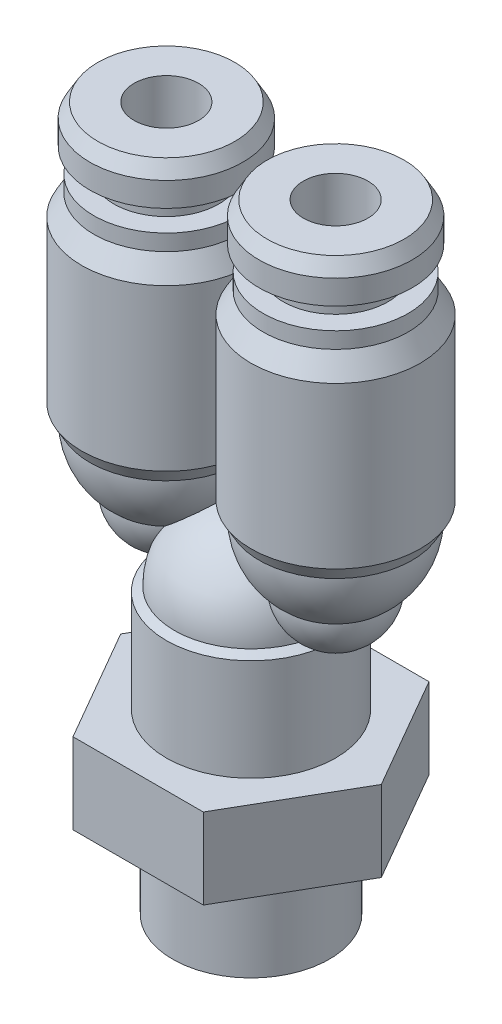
ISO-10303-21;
HEADER;
FILE_DESCRIPTION(('STEP AP214'),'2;1');
FILE_NAME('part.step','',(''),(''),'','','');
FILE_SCHEMA(('AUTOMOTIVE_DESIGN { 1 0 10303 214 1 1 1 1 }'));
ENDSEC;
DATA;
#1=APPLICATION_CONTEXT('core data for automotive mechanical design processes');
#2=APPLICATION_PROTOCOL_DEFINITION('international standard','automotive_design',2000,#1);
#3=PRODUCT_CONTEXT('',#1,'mechanical');
#4=PRODUCT('Part','Part','',(#3));
#5=PRODUCT_RELATED_PRODUCT_CATEGORY('part','',(#4));
#6=PRODUCT_DEFINITION_FORMATION('','',#4);
#7=PRODUCT_DEFINITION_CONTEXT('part definition',#1,'design');
#8=PRODUCT_DEFINITION('design','',#6,#7);
#9=PRODUCT_DEFINITION_SHAPE('','',#8);
#10=(LENGTH_UNIT() NAMED_UNIT(*) SI_UNIT(.MILLI.,.METRE.));
#11=(NAMED_UNIT(*) PLANE_ANGLE_UNIT() SI_UNIT($,.RADIAN.));
#12=(NAMED_UNIT(*) SI_UNIT($,.STERADIAN.) SOLID_ANGLE_UNIT());
#13=UNCERTAINTY_MEASURE_WITH_UNIT(LENGTH_MEASURE(1.E-05),#10,'distance_accuracy_value','');
#14=(GEOMETRIC_REPRESENTATION_CONTEXT(3) GLOBAL_UNCERTAINTY_ASSIGNED_CONTEXT((#13)) GLOBAL_UNIT_ASSIGNED_CONTEXT((#10,
#11,#12)) REPRESENTATION_CONTEXT('',''));
#15=CARTESIAN_POINT('',(0.,0.,0.));
#16=DIRECTION('',(0.,0.,1.));
#17=DIRECTION('',(1.,0.,0.));
#18=AXIS2_PLACEMENT_3D('',#15,#16,#17);
#19=CARTESIAN_POINT('',(9.,-18.,0.));
#20=DIRECTION('',(0.,1.,0.));
#21=DIRECTION('',(-1.,0.,0.));
#22=AXIS2_PLACEMENT_3D('',#19,#20,#21);
#23=PLANE('',#22);
#24=CARTESIAN_POINT('',(0.,-18.,0.));
#25=DIRECTION('',(0.,1.,0.));
#26=DIRECTION('',(-1.,0.,0.));
#27=AXIS2_PLACEMENT_3D('',#24,#25,#26);
#28=CIRCLE('',#27,4.86399999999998);
#29=CARTESIAN_POINT('',(-4.86399999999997,-18.,0.));
#30=VERTEX_POINT('',#29);
#31=EDGE_CURVE('P0_E24',#30,#30,#28,.T.);
#32=ORIENTED_EDGE('',*,*,#31,.T.);
#33=EDGE_LOOP('',(#32));
#34=FACE_BOUND('',#33,.T.);
#35=DIRECTION('',(0.5,0.,0.866025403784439));
#36=VECTOR('',#35,1.);
#37=CARTESIAN_POINT('',(4.04145188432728,-18.,-7.));
#38=LINE('',#37,#36);
#39=CARTESIAN_POINT('',(4.04145188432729,-18.,-7.));
#40=VERTEX_POINT('',#39);
#41=CARTESIAN_POINT('',(8.08290376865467,-18.,0.));
#42=VERTEX_POINT('',#41);
#43=EDGE_CURVE('P0_E31',#40,#42,#38,.T.);
#44=ORIENTED_EDGE('',*,*,#43,.T.);
#45=DIRECTION('',(-0.5,0.,0.866025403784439));
#46=VECTOR('',#45,1.);
#47=CARTESIAN_POINT('',(8.08290376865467,-18.,0.));
#48=LINE('',#47,#46);
#49=CARTESIAN_POINT('',(4.04145188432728,-18.,7.));
#50=VERTEX_POINT('',#49);
#51=EDGE_CURVE('P0_E79',#42,#50,#48,.T.);
#52=ORIENTED_EDGE('',*,*,#51,.T.);
#53=DIRECTION('',(-1.,0.,0.));
#54=VECTOR('',#53,1.);
#55=CARTESIAN_POINT('',(4.04145188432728,-18.,7.));
#56=LINE('',#55,#54);
#57=CARTESIAN_POINT('',(-4.04145188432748,-18.,7.));
#58=VERTEX_POINT('',#57);
#59=EDGE_CURVE('P0_E85',#50,#58,#56,.T.);
#60=ORIENTED_EDGE('',*,*,#59,.T.);
#61=DIRECTION('',(-0.5,0.,-0.866025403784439));
#62=VECTOR('',#61,1.);
#63=CARTESIAN_POINT('',(-4.04145188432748,-18.,7.));
#64=LINE('',#63,#62);
#65=CARTESIAN_POINT('',(-8.08290376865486,-18.,0.));
#66=VERTEX_POINT('',#65);
#67=EDGE_CURVE('P0_E95',#58,#66,#64,.T.);
#68=ORIENTED_EDGE('',*,*,#67,.T.);
#69=DIRECTION('',(0.5,0.,-0.866025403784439));
#70=VECTOR('',#69,1.);
#71=CARTESIAN_POINT('',(-8.08290376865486,-18.,0.));
#72=LINE('',#71,#70);
#73=CARTESIAN_POINT('',(-4.04145188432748,-18.,-7.));
#74=VERTEX_POINT('',#73);
#75=EDGE_CURVE('P0_E98',#66,#74,#72,.T.);
#76=ORIENTED_EDGE('',*,*,#75,.T.);
#77=DIRECTION('',(1.,0.,0.));
#78=VECTOR('',#77,1.);
#79=CARTESIAN_POINT('',(-4.04145188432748,-18.,-7.));
#80=LINE('',#79,#78);
#81=EDGE_CURVE('P0_E89',#74,#40,#80,.T.);
#82=ORIENTED_EDGE('',*,*,#81,.T.);
#83=EDGE_LOOP('',(#44,#52,#60,#68,#76,#82));
#84=FACE_BOUND('',#83,.T.);
#85=ADVANCED_FACE('P0_F16',(#34,#84),#23,.F.);
#86=CARTESIAN_POINT('',(0.,-24.,0.));
#87=DIRECTION('',(0.,1.,0.));
#88=DIRECTION('',(-1.,0.,0.));
#89=AXIS2_PLACEMENT_3D('',#86,#87,#88);
#90=PLANE('',#89);
#91=CARTESIAN_POINT('',(0.,-24.,0.));
#92=DIRECTION('',(0.,-1.,0.));
#93=DIRECTION('',(1.,0.,0.));
#94=AXIS2_PLACEMENT_3D('',#91,#92,#93);
#95=CIRCLE('',#94,1.49999999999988);
#96=CARTESIAN_POINT('',(1.49999999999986,-24.,0.));
#97=VERTEX_POINT('',#96);
#98=EDGE_CURVE('P0_E113',#97,#97,#95,.T.);
#99=ORIENTED_EDGE('',*,*,#98,.F.);
#100=EDGE_LOOP('',(#99));
#101=FACE_BOUND('',#100,.T.);
#102=CARTESIAN_POINT('',(0.,-24.,0.));
#103=DIRECTION('',(0.,1.,0.));
#104=DIRECTION('',(-1.,0.,0.));
#105=AXIS2_PLACEMENT_3D('',#102,#103,#104);
#106=CIRCLE('',#105,4.864);
#107=CARTESIAN_POINT('',(-4.864,-24.,0.));
#108=VERTEX_POINT('',#107);
#109=EDGE_CURVE('P0_E10',#108,#108,#106,.T.);
#110=ORIENTED_EDGE('',*,*,#109,.F.);
#111=EDGE_LOOP('',(#110));
#112=FACE_BOUND('',#111,.T.);
#113=ADVANCED_FACE('P0_F18',(#101,#112),#90,.F.);
#114=CARTESIAN_POINT('',(0.,-24.,0.));
#115=DIRECTION('',(0.,1.,0.));
#116=DIRECTION('',(-1.,0.,0.));
#117=AXIS2_PLACEMENT_3D('',#114,#115,#116);
#118=CYLINDRICAL_SURFACE('',#117,4.86399999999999);
#119=ORIENTED_EDGE('',*,*,#31,.F.);
#120=EDGE_LOOP('',(#119));
#121=FACE_BOUND('',#120,.T.);
#122=ORIENTED_EDGE('',*,*,#109,.T.);
#123=EDGE_LOOP('',(#122));
#124=FACE_BOUND('',#123,.T.);
#125=ADVANCED_FACE('P0_F128',(#121,#124),#118,.T.);
#126=CARTESIAN_POINT('',(0.,-6.99999999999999,0.));
#127=DIRECTION('',(0.,-1.,0.));
#128=DIRECTION('',(1.,0.,0.));
#129=AXIS2_PLACEMENT_3D('',#126,#127,#128);
#130=CYLINDRICAL_SURFACE('',#129,1.49999999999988);
#131=CARTESIAN_POINT('',(0.,-6.99999999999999,0.));
#132=DIRECTION('',(0.,-1.,0.));
#133=DIRECTION('',(1.,0.,0.));
#134=AXIS2_PLACEMENT_3D('',#131,#132,#133);
#135=CIRCLE('',#134,1.49999999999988);
#136=CARTESIAN_POINT('',(1.49999999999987,-6.99999999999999,0.));
#137=VERTEX_POINT('',#136);
#138=EDGE_CURVE('P0_E109',#137,#137,#135,.T.);
#139=ORIENTED_EDGE('',*,*,#138,.F.);
#140=EDGE_LOOP('',(#139));
#141=FACE_BOUND('',#140,.T.);
#142=ORIENTED_EDGE('',*,*,#98,.T.);
#143=EDGE_LOOP('',(#142));
#144=FACE_BOUND('',#143,.T.);
#145=ADVANCED_FACE('P0_F131',(#141,#144),#130,.F.);
#146=CARTESIAN_POINT('',(0.,-6.99999999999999,0.));
#147=DIRECTION('',(0.,-1.,0.));
#148=DIRECTION('',(1.,0.,0.));
#149=AXIS2_PLACEMENT_3D('',#146,#147,#148);
#150=PLANE('',#149);
#151=ORIENTED_EDGE('',*,*,#138,.T.);
#152=EDGE_LOOP('',(#151));
#153=FACE_BOUND('',#152,.T.);
#154=ADVANCED_FACE('P0_F144',(#153),#150,.T.);
#155=CARTESIAN_POINT('',(4.04145188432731,14.9352197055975,-7.));
#156=DIRECTION('',(0.866025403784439,0.,-0.5));
#157=DIRECTION('',(-0.5,0.,-0.866025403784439));
#158=AXIS2_PLACEMENT_3D('',#155,#156,#157);
#159=PLANE('',#158);
#160=DIRECTION('',(0.,-1.,0.));
#161=VECTOR('',#160,1.);
#162=CARTESIAN_POINT('',(8.08290376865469,14.9352197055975,0.));
#163=LINE('',#162,#161);
#164=CARTESIAN_POINT('',(8.08290376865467,-13.,0.));
#165=VERTEX_POINT('',#164);
#166=EDGE_CURVE('P0_E68',#165,#42,#163,.T.);
#167=ORIENTED_EDGE('',*,*,#166,.T.);
#168=ORIENTED_EDGE('',*,*,#43,.F.);
#169=DIRECTION('',(0.,-1.,0.));
#170=VECTOR('',#169,1.);
#171=CARTESIAN_POINT('',(4.04145188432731,14.9352197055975,-7.));
#172=LINE('',#171,#170);
#173=CARTESIAN_POINT('',(4.04145188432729,-13.,-7.));
#174=VERTEX_POINT('',#173);
#175=EDGE_CURVE('P0_E76',#174,#40,#172,.T.);
#176=ORIENTED_EDGE('',*,*,#175,.F.);
#177=DIRECTION('',(-0.5,0.,-0.866025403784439));
#178=VECTOR('',#177,1.);
#179=CARTESIAN_POINT('',(4.04145188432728,-13.,-7.00000000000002));
#180=LINE('',#179,#178);
#181=EDGE_CURVE('P0_E72',#165,#174,#180,.T.);
#182=ORIENTED_EDGE('',*,*,#181,.F.);
#183=EDGE_LOOP('',(#167,#168,#176,#182));
#184=FACE_BOUND('',#183,.T.);
#185=ADVANCED_FACE('P0_F70',(#184),#159,.T.);
#186=CARTESIAN_POINT('',(8.08290376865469,14.9352197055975,0.));
#187=DIRECTION('',(0.866025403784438,0.,0.5));
#188=DIRECTION('',(0.5,0.,-0.866025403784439));
#189=AXIS2_PLACEMENT_3D('',#186,#187,#188);
#190=PLANE('',#189);
#191=DIRECTION('',(0.,-1.,0.));
#192=VECTOR('',#191,1.);
#193=CARTESIAN_POINT('',(4.04145188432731,14.9352197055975,7.));
#194=LINE('',#193,#192);
#195=CARTESIAN_POINT('',(4.04145188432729,-13.,7.));
#196=VERTEX_POINT('',#195);
#197=EDGE_CURVE('P0_E75',#196,#50,#194,.T.);
#198=ORIENTED_EDGE('',*,*,#197,.T.);
#199=ORIENTED_EDGE('',*,*,#51,.F.);
#200=ORIENTED_EDGE('',*,*,#166,.F.);
#201=DIRECTION('',(0.5,0.,-0.866025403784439));
#202=VECTOR('',#201,1.);
#203=CARTESIAN_POINT('',(8.08290376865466,-13.,0.));
#204=LINE('',#203,#202);
#205=EDGE_CURVE('P0_E116',#196,#165,#204,.T.);
#206=ORIENTED_EDGE('',*,*,#205,.F.);
#207=EDGE_LOOP('',(#198,#199,#200,#206));
#208=FACE_BOUND('',#207,.T.);
#209=ADVANCED_FACE('P0_F80',(#208),#190,.T.);
#210=CARTESIAN_POINT('',(4.04145188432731,14.9352197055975,7.));
#211=DIRECTION('',(0.,0.,1.));
#212=DIRECTION('',(1.,0.,0.));
#213=AXIS2_PLACEMENT_3D('',#210,#211,#212);
#214=PLANE('',#213);
#215=DIRECTION('',(0.,-1.,0.));
#216=VECTOR('',#215,1.);
#217=CARTESIAN_POINT('',(-4.04145188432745,14.9352197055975,7.));
#218=LINE('',#217,#216);
#219=CARTESIAN_POINT('',(-4.04145188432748,-13.,7.));
#220=VERTEX_POINT('',#219);
#221=EDGE_CURVE('P0_E103',#220,#58,#218,.T.);
#222=ORIENTED_EDGE('',*,*,#221,.T.);
#223=ORIENTED_EDGE('',*,*,#59,.F.);
#224=ORIENTED_EDGE('',*,*,#197,.F.);
#225=DIRECTION('',(1.,0.,0.));
#226=VECTOR('',#225,1.);
#227=CARTESIAN_POINT('',(4.04145188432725,-13.,7.));
#228=LINE('',#227,#226);
#229=EDGE_CURVE('P0_E179',#220,#196,#228,.T.);
#230=ORIENTED_EDGE('',*,*,#229,.F.);
#231=EDGE_LOOP('',(#222,#223,#224,#230));
#232=FACE_BOUND('',#231,.T.);
#233=ADVANCED_FACE('P0_F195',(#232),#214,.T.);
#234=CARTESIAN_POINT('',(-4.04145188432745,14.9352197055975,7.));
#235=DIRECTION('',(-0.866025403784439,0.,0.5));
#236=DIRECTION('',(0.5,0.,0.866025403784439));
#237=AXIS2_PLACEMENT_3D('',#234,#235,#236);
#238=PLANE('',#237);
#239=DIRECTION('',(0.,-1.,0.));
#240=VECTOR('',#239,1.);
#241=CARTESIAN_POINT('',(-8.08290376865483,14.9352197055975,0.));
#242=LINE('',#241,#240);
#243=CARTESIAN_POINT('',(-8.08290376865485,-13.,0.));
#244=VERTEX_POINT('',#243);
#245=EDGE_CURVE('P0_E101',#244,#66,#242,.T.);
#246=ORIENTED_EDGE('',*,*,#245,.T.);
#247=ORIENTED_EDGE('',*,*,#67,.F.);
#248=ORIENTED_EDGE('',*,*,#221,.F.);
#249=DIRECTION('',(0.5,0.,0.866025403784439));
#250=VECTOR('',#249,1.);
#251=CARTESIAN_POINT('',(-4.04145188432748,-13.,6.99999999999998));
#252=LINE('',#251,#250);
#253=EDGE_CURVE('P0_E181',#244,#220,#252,.T.);
#254=ORIENTED_EDGE('',*,*,#253,.F.);
#255=EDGE_LOOP('',(#246,#247,#248,#254));
#256=FACE_BOUND('',#255,.T.);
#257=ADVANCED_FACE('P0_F192',(#256),#238,.T.);
#258=CARTESIAN_POINT('',(-8.08290376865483,14.9352197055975,0.));
#259=DIRECTION('',(-0.866025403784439,0.,-0.5));
#260=DIRECTION('',(-0.5,0.,0.866025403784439));
#261=AXIS2_PLACEMENT_3D('',#258,#259,#260);
#262=PLANE('',#261);
#263=DIRECTION('',(0.,-1.,0.));
#264=VECTOR('',#263,1.);
#265=CARTESIAN_POINT('',(-4.04145188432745,14.9352197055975,-7.));
#266=LINE('',#265,#264);
#267=CARTESIAN_POINT('',(-4.04145188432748,-13.,-7.));
#268=VERTEX_POINT('',#267);
#269=EDGE_CURVE('P0_E39',#268,#74,#266,.T.);
#270=ORIENTED_EDGE('',*,*,#269,.T.);
#271=ORIENTED_EDGE('',*,*,#75,.F.);
#272=ORIENTED_EDGE('',*,*,#245,.F.);
#273=DIRECTION('',(-0.5,0.,0.866025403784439));
#274=VECTOR('',#273,1.);
#275=CARTESIAN_POINT('',(-8.08290376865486,-13.,0.));
#276=LINE('',#275,#274);
#277=EDGE_CURVE('P0_E185',#268,#244,#276,.T.);
#278=ORIENTED_EDGE('',*,*,#277,.F.);
#279=EDGE_LOOP('',(#270,#271,#272,#278));
#280=FACE_BOUND('',#279,.T.);
#281=ADVANCED_FACE('P0_F188',(#280),#262,.T.);
#282=CARTESIAN_POINT('',(-4.04145188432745,14.9352197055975,-7.));
#283=DIRECTION('',(0.,0.,-1.));
#284=DIRECTION('',(-1.,0.,0.));
#285=AXIS2_PLACEMENT_3D('',#282,#283,#284);
#286=PLANE('',#285);
#287=ORIENTED_EDGE('',*,*,#175,.T.);
#288=ORIENTED_EDGE('',*,*,#81,.F.);
#289=ORIENTED_EDGE('',*,*,#269,.F.);
#290=DIRECTION('',(-1.,0.,0.));
#291=VECTOR('',#290,1.);
#292=CARTESIAN_POINT('',(-4.04145188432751,-13.,-7.));
#293=LINE('',#292,#291);
#294=EDGE_CURVE('P0_E108',#174,#268,#293,.T.);
#295=ORIENTED_EDGE('',*,*,#294,.F.);
#296=EDGE_LOOP('',(#287,#288,#289,#295));
#297=FACE_BOUND('',#296,.T.);
#298=ADVANCED_FACE('P0_F159',(#297),#286,.T.);
#299=CARTESIAN_POINT('',(0.,-6.4,0.));
#300=DIRECTION('',(0.,1.,0.));
#301=DIRECTION('',(1.,0.,0.));
#302=AXIS2_PLACEMENT_3D('',#299,#300,#301);
#303=SPHERICAL_SURFACE('',#302,4.75);
#304=CARTESIAN_POINT('',(0.,-6.39999999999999,0.));
#305=DIRECTION('',(0.,1.,0.));
#306=DIRECTION('',(-1.,0.,0.));
#307=AXIS2_PLACEMENT_3D('',#304,#305,#306);
#308=CIRCLE('',#307,4.74999999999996);
#309=CARTESIAN_POINT('',(-4.74999999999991,-6.39999999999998,0.));
#310=VERTEX_POINT('',#309);
#311=EDGE_CURVE('P0_E112',#310,#310,#308,.T.);
#312=ORIENTED_EDGE('',*,*,#311,.T.);
#313=EDGE_LOOP('',(#312));
#314=FACE_BOUND('',#313,.T.);
#315=ADVANCED_FACE('P0_F155',(#314),#303,.T.);
#316=CARTESIAN_POINT('',(0.,-6.6886751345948,0.));
#317=DIRECTION('',(0.,-1.,0.));
#318=DIRECTION('',(1.,0.,0.));
#319=AXIS2_PLACEMENT_3D('',#316,#317,#318);
#320=CONICAL_SURFACE('',#319,5.24999999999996,1.0471975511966);
#321=ORIENTED_EDGE('',*,*,#311,.F.);
#322=EDGE_LOOP('',(#321));
#323=FACE_BOUND('',#322,.T.);
#324=CARTESIAN_POINT('',(0.,-6.6886751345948,0.));
#325=DIRECTION('',(0.,1.,0.));
#326=DIRECTION('',(-1.,0.,0.));
#327=AXIS2_PLACEMENT_3D('',#324,#325,#326);
#328=CIRCLE('',#327,5.24999999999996);
#329=CARTESIAN_POINT('',(-5.24999999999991,-6.68867513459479,0.));
#330=VERTEX_POINT('',#329);
#331=EDGE_CURVE('P0_E119',#330,#330,#328,.T.);
#332=ORIENTED_EDGE('',*,*,#331,.T.);
#333=EDGE_LOOP('',(#332));
#334=FACE_BOUND('',#333,.T.);
#335=ADVANCED_FACE('P0_F158',(#323,#334),#320,.T.);
#336=CARTESIAN_POINT('',(0.,-24.,0.));
#337=DIRECTION('',(0.,1.,0.));
#338=DIRECTION('',(-1.,0.,0.));
#339=AXIS2_PLACEMENT_3D('',#336,#337,#338);
#340=CYLINDRICAL_SURFACE('',#339,5.24999999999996);
#341=ORIENTED_EDGE('',*,*,#331,.F.);
#342=EDGE_LOOP('',(#341));
#343=FACE_BOUND('',#342,.T.);
#344=CARTESIAN_POINT('',(0.,-13.,0.));
#345=DIRECTION('',(0.,1.,0.));
#346=DIRECTION('',(-1.,0.,0.));
#347=AXIS2_PLACEMENT_3D('',#344,#345,#346);
#348=CIRCLE('',#347,5.24999999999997);
#349=CARTESIAN_POINT('',(-5.24999999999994,-13.,0.));
#350=VERTEX_POINT('',#349);
#351=EDGE_CURVE('P0_E122',#350,#350,#348,.T.);
#352=ORIENTED_EDGE('',*,*,#351,.T.);
#353=EDGE_LOOP('',(#352));
#354=FACE_BOUND('',#353,.T.);
#355=ADVANCED_FACE('P0_F163',(#343,#354),#340,.T.);
#356=CARTESIAN_POINT('',(5.25,-13.,0.));
#357=DIRECTION('',(0.,-1.,0.));
#358=DIRECTION('',(1.,0.,0.));
#359=AXIS2_PLACEMENT_3D('',#356,#357,#358);
#360=PLANE('',#359);
#361=ORIENTED_EDGE('',*,*,#351,.F.);
#362=EDGE_LOOP('',(#361));
#363=FACE_BOUND('',#362,.T.);
#364=ORIENTED_EDGE('',*,*,#181,.T.);
#365=ORIENTED_EDGE('',*,*,#294,.T.);
#366=ORIENTED_EDGE('',*,*,#277,.T.);
#367=ORIENTED_EDGE('',*,*,#253,.T.);
#368=ORIENTED_EDGE('',*,*,#229,.T.);
#369=ORIENTED_EDGE('',*,*,#205,.T.);
#370=EDGE_LOOP('',(#364,#365,#366,#367,#368,#369));
#371=FACE_BOUND('',#370,.T.);
#372=ADVANCED_FACE('P0_F167',(#363,#371),#360,.F.);
#373=CLOSED_SHELL('',(#85,#113,#125,#145,#154,#185,#209,#233,#257,#281,#298,#315,#335,#355,#372));
#374=MANIFOLD_SOLID_BREP('P0_B1',#373);
#375=CARTESIAN_POINT('',(5.25,17.,0.));
#376=DIRECTION('',(0.,1.,0.));
#377=DIRECTION('',(0.,0.,1.));
#378=AXIS2_PLACEMENT_3D('',#375,#376,#377);
#379=PLANE('',#378);
#380=CARTESIAN_POINT('',(5.25,17.,0.));
#381=DIRECTION('',(0.,1.,0.));
#382=DIRECTION('',(0.,0.,1.));
#383=AXIS2_PLACEMENT_3D('',#380,#381,#382);
#384=CIRCLE('',#383,2.);
#385=CARTESIAN_POINT('',(5.25,17.,2.));
#386=VERTEX_POINT('',#385);
#387=EDGE_CURVE('P1_E56',#386,#386,#384,.T.);
#388=ORIENTED_EDGE('',*,*,#387,.F.);
#389=EDGE_LOOP('',(#388));
#390=FACE_BOUND('',#389,.T.);
#391=CARTESIAN_POINT('',(5.25,17.,0.));
#392=DIRECTION('',(0.,-1.,0.));
#393=DIRECTION('',(0.,0.,-1.));
#394=AXIS2_PLACEMENT_3D('',#391,#392,#393);
#395=CIRCLE('',#394,4.25);
#396=CARTESIAN_POINT('',(5.25,17.,-4.25));
#397=VERTEX_POINT('',#396);
#398=EDGE_CURVE('P1_E10',#397,#397,#395,.T.);
#399=ORIENTED_EDGE('',*,*,#398,.F.);
#400=EDGE_LOOP('',(#399));
#401=FACE_BOUND('',#400,.T.);
#402=ADVANCED_FACE('P1_F15',(#390,#401),#379,.T.);
#403=CARTESIAN_POINT('',(5.25,16.1339745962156,0.));
#404=DIRECTION('',(0.,-1.,0.));
#405=DIRECTION('',(0.,0.,-1.));
#406=AXIS2_PLACEMENT_3D('',#403,#404,#405);
#407=CONICAL_SURFACE('',#406,4.75,0.523598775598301);
#408=ORIENTED_EDGE('',*,*,#398,.T.);
#409=EDGE_LOOP('',(#408));
#410=FACE_BOUND('',#409,.T.);
#411=CARTESIAN_POINT('',(5.25,16.1339745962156,0.));
#412=DIRECTION('',(0.,-1.,0.));
#413=DIRECTION('',(0.,0.,-1.));
#414=AXIS2_PLACEMENT_3D('',#411,#412,#413);
#415=CIRCLE('',#414,4.75);
#416=CARTESIAN_POINT('',(5.25,16.1339745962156,-4.75));
#417=VERTEX_POINT('',#416);
#418=EDGE_CURVE('P1_E21',#417,#417,#415,.T.);
#419=ORIENTED_EDGE('',*,*,#418,.F.);
#420=EDGE_LOOP('',(#419));
#421=FACE_BOUND('',#420,.T.);
#422=ADVANCED_FACE('P1_F73',(#410,#421),#407,.T.);
#423=CARTESIAN_POINT('',(5.25,17.,0.));
#424=DIRECTION('',(0.,-1.,0.));
#425=DIRECTION('',(0.,0.,-1.));
#426=AXIS2_PLACEMENT_3D('',#423,#424,#425);
#427=CYLINDRICAL_SURFACE('',#426,4.75);
#428=ORIENTED_EDGE('',*,*,#418,.T.);
#429=EDGE_LOOP('',(#428));
#430=FACE_BOUND('',#429,.T.);
#431=CARTESIAN_POINT('',(5.25,14.6339745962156,0.));
#432=DIRECTION('',(0.,-1.,0.));
#433=DIRECTION('',(0.,0.,-1.));
#434=AXIS2_PLACEMENT_3D('',#431,#432,#433);
#435=CIRCLE('',#434,4.75);
#436=CARTESIAN_POINT('',(5.25,14.6339745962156,-4.75));
#437=VERTEX_POINT('',#436);
#438=EDGE_CURVE('P1_E25',#437,#437,#435,.T.);
#439=ORIENTED_EDGE('',*,*,#438,.F.);
#440=EDGE_LOOP('',(#439));
#441=FACE_BOUND('',#440,.T.);
#442=ADVANCED_FACE('P1_F78',(#430,#441),#427,.T.);
#443=CARTESIAN_POINT('',(10.,14.6339745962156,0.));
#444=DIRECTION('',(0.,-1.,0.));
#445=DIRECTION('',(0.,0.,-1.));
#446=AXIS2_PLACEMENT_3D('',#443,#444,#445);
#447=PLANE('',#446);
#448=ORIENTED_EDGE('',*,*,#438,.T.);
#449=EDGE_LOOP('',(#448));
#450=FACE_BOUND('',#449,.T.);
#451=CARTESIAN_POINT('',(5.25,14.6339745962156,0.));
#452=DIRECTION('',(0.,-1.,0.));
#453=DIRECTION('',(0.,0.,-1.));
#454=AXIS2_PLACEMENT_3D('',#451,#452,#453);
#455=CIRCLE('',#454,3.25);
#456=CARTESIAN_POINT('',(5.25,14.6339745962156,-3.25));
#457=VERTEX_POINT('',#456);
#458=EDGE_CURVE('P1_E29',#457,#457,#455,.T.);
#459=ORIENTED_EDGE('',*,*,#458,.F.);
#460=EDGE_LOOP('',(#459));
#461=FACE_BOUND('',#460,.T.);
#462=ADVANCED_FACE('P1_F82',(#450,#461),#447,.T.);
#463=CARTESIAN_POINT('',(5.25,17.,0.));
#464=DIRECTION('',(0.,-1.,0.));
#465=DIRECTION('',(0.,0.,-1.));
#466=AXIS2_PLACEMENT_3D('',#463,#464,#465);
#467=CYLINDRICAL_SURFACE('',#466,3.24999999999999);
#468=ORIENTED_EDGE('',*,*,#458,.T.);
#469=EDGE_LOOP('',(#468));
#470=FACE_BOUND('',#469,.T.);
#471=CARTESIAN_POINT('',(5.25,13.1339745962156,0.));
#472=DIRECTION('',(0.,-1.,0.));
#473=DIRECTION('',(0.,0.,-1.));
#474=AXIS2_PLACEMENT_3D('',#471,#472,#473);
#475=CIRCLE('',#474,3.24999999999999);
#476=CARTESIAN_POINT('',(5.25,13.1339745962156,-3.24999999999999));
#477=VERTEX_POINT('',#476);
#478=EDGE_CURVE('P1_E34',#477,#477,#475,.T.);
#479=ORIENTED_EDGE('',*,*,#478,.F.);
#480=EDGE_LOOP('',(#479));
#481=FACE_BOUND('',#480,.T.);
#482=ADVANCED_FACE('P1_F88',(#470,#481),#467,.T.);
#483=CARTESIAN_POINT('',(8.49999999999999,13.1339745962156,0.));
#484=DIRECTION('',(0.,1.,0.));
#485=DIRECTION('',(0.,0.,1.));
#486=AXIS2_PLACEMENT_3D('',#483,#484,#485);
#487=PLANE('',#486);
#488=ORIENTED_EDGE('',*,*,#478,.T.);
#489=EDGE_LOOP('',(#488));
#490=FACE_BOUND('',#489,.T.);
#491=CARTESIAN_POINT('',(5.25,13.1339745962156,0.));
#492=DIRECTION('',(0.,-1.,0.));
#493=DIRECTION('',(0.,0.,-1.));
#494=AXIS2_PLACEMENT_3D('',#491,#492,#493);
#495=CIRCLE('',#494,4.5);
#496=CARTESIAN_POINT('',(5.25,13.1339745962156,-4.5));
#497=VERTEX_POINT('',#496);
#498=EDGE_CURVE('P1_E37',#497,#497,#495,.T.);
#499=ORIENTED_EDGE('',*,*,#498,.F.);
#500=EDGE_LOOP('',(#499));
#501=FACE_BOUND('',#500,.T.);
#502=ADVANCED_FACE('P1_F92',(#490,#501),#487,.T.);
#503=CARTESIAN_POINT('',(5.25,17.,0.));
#504=DIRECTION('',(0.,-1.,0.));
#505=DIRECTION('',(0.,0.,-1.));
#506=AXIS2_PLACEMENT_3D('',#503,#504,#505);
#507=CYLINDRICAL_SURFACE('',#506,4.5);
#508=ORIENTED_EDGE('',*,*,#498,.T.);
#509=EDGE_LOOP('',(#508));
#510=FACE_BOUND('',#509,.T.);
#511=CARTESIAN_POINT('',(5.25,12.1339745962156,0.));
#512=DIRECTION('',(0.,-1.,0.));
#513=DIRECTION('',(0.,0.,-1.));
#514=AXIS2_PLACEMENT_3D('',#511,#512,#513);
#515=CIRCLE('',#514,4.5);
#516=CARTESIAN_POINT('',(5.25,12.1339745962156,-4.5));
#517=VERTEX_POINT('',#516);
#518=EDGE_CURVE('P1_E40',#517,#517,#515,.T.);
#519=ORIENTED_EDGE('',*,*,#518,.F.);
#520=EDGE_LOOP('',(#519));
#521=FACE_BOUND('',#520,.T.);
#522=ADVANCED_FACE('P1_F96',(#510,#521),#507,.T.);
#523=CARTESIAN_POINT('',(5.25,10.8349364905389,0.));
#524=DIRECTION('',(0.,-1.,0.));
#525=DIRECTION('',(0.,0.,-1.));
#526=AXIS2_PLACEMENT_3D('',#523,#524,#525);
#527=CONICAL_SURFACE('',#526,5.25,0.523598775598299);
#528=ORIENTED_EDGE('',*,*,#518,.T.);
#529=EDGE_LOOP('',(#528));
#530=FACE_BOUND('',#529,.T.);
#531=CARTESIAN_POINT('',(5.25,10.8349364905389,0.));
#532=DIRECTION('',(0.,-1.,0.));
#533=DIRECTION('',(0.,0.,-1.));
#534=AXIS2_PLACEMENT_3D('',#531,#532,#533);
#535=CIRCLE('',#534,5.25);
#536=CARTESIAN_POINT('',(5.25,10.8349364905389,-5.25));
#537=VERTEX_POINT('',#536);
#538=EDGE_CURVE('P1_E43',#537,#537,#535,.T.);
#539=ORIENTED_EDGE('',*,*,#538,.F.);
#540=EDGE_LOOP('',(#539));
#541=FACE_BOUND('',#540,.T.);
#542=ADVANCED_FACE('P1_F100',(#530,#541),#527,.T.);
#543=CARTESIAN_POINT('',(5.25,17.,0.));
#544=DIRECTION('',(0.,-1.,0.));
#545=DIRECTION('',(0.,0.,-1.));
#546=AXIS2_PLACEMENT_3D('',#543,#544,#545);
#547=CYLINDRICAL_SURFACE('',#546,5.25);
#548=ORIENTED_EDGE('',*,*,#538,.T.);
#549=EDGE_LOOP('',(#548));
#550=FACE_BOUND('',#549,.T.);
#551=CARTESIAN_POINT('',(5.25,0.866025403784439,0.));
#552=DIRECTION('',(0.,-1.,0.));
#553=DIRECTION('',(0.,0.,-1.));
#554=AXIS2_PLACEMENT_3D('',#551,#552,#553);
#555=CIRCLE('',#554,5.25);
#556=CARTESIAN_POINT('',(5.25,0.866025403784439,-5.25));
#557=VERTEX_POINT('',#556);
#558=EDGE_CURVE('P1_E46',#557,#557,#555,.T.);
#559=ORIENTED_EDGE('',*,*,#558,.F.);
#560=EDGE_LOOP('',(#559));
#561=FACE_BOUND('',#560,.T.);
#562=ADVANCED_FACE('P1_F104',(#550,#561),#547,.T.);
#563=CARTESIAN_POINT('',(5.25,0.,0.));
#564=DIRECTION('',(0.,1.,0.));
#565=DIRECTION('',(0.,0.,1.));
#566=AXIS2_PLACEMENT_3D('',#563,#564,#565);
#567=CONICAL_SURFACE('',#566,4.75,0.5235987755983);
#568=ORIENTED_EDGE('',*,*,#558,.T.);
#569=EDGE_LOOP('',(#568));
#570=FACE_BOUND('',#569,.T.);
#571=CARTESIAN_POINT('',(5.25,0.,0.));
#572=DIRECTION('',(0.,-1.,0.));
#573=DIRECTION('',(0.,0.,-1.));
#574=AXIS2_PLACEMENT_3D('',#571,#572,#573);
#575=CIRCLE('',#574,4.75);
#576=CARTESIAN_POINT('',(5.25,0.,-4.75));
#577=VERTEX_POINT('',#576);
#578=EDGE_CURVE('P1_E49',#577,#577,#575,.T.);
#579=ORIENTED_EDGE('',*,*,#578,.F.);
#580=EDGE_LOOP('',(#579));
#581=FACE_BOUND('',#580,.T.);
#582=ADVANCED_FACE('P1_F108',(#570,#581),#567,.T.);
#583=CARTESIAN_POINT('',(5.25,0.,0.));
#584=DIRECTION('',(0.,-1.,0.));
#585=DIRECTION('',(1.,0.,0.));
#586=AXIS2_PLACEMENT_3D('',#583,#584,#585);
#587=SPHERICAL_SURFACE('',#586,4.75);
#588=ORIENTED_EDGE('',*,*,#578,.T.);
#589=EDGE_LOOP('',(#588));
#590=FACE_BOUND('',#589,.T.);
#591=CARTESIAN_POINT('',(5.25,-3.6552334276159,0.));
#592=DIRECTION('',(0.,-1.,0.));
#593=DIRECTION('',(0.,0.,-1.));
#594=AXIS2_PLACEMENT_3D('',#591,#592,#593);
#595=CIRCLE('',#594,3.03344170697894);
#596=CARTESIAN_POINT('',(5.25,-3.6552334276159,-3.03344170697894));
#597=VERTEX_POINT('',#596);
#598=EDGE_CURVE('P1_E52',#597,#597,#595,.T.);
#599=ORIENTED_EDGE('',*,*,#598,.F.);
#600=EDGE_LOOP('',(#599));
#601=FACE_BOUND('',#600,.T.);
#602=ADVANCED_FACE('P1_F112',(#590,#601),#587,.T.);
#603=CARTESIAN_POINT('',(5.25,-3.6552334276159,0.));
#604=DIRECTION('',(0.,-1.,0.));
#605=DIRECTION('',(1.,0.,0.));
#606=AXIS2_PLACEMENT_3D('',#603,#604,#605);
#607=SPHERICAL_SURFACE('',#606,3.03344170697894);
#608=ORIENTED_EDGE('',*,*,#598,.T.);
#609=EDGE_LOOP('',(#608));
#610=FACE_BOUND('',#609,.T.);
#611=ADVANCED_FACE('P1_F67',(#610),#607,.T.);
#612=CARTESIAN_POINT('',(5.25,0.,0.));
#613=DIRECTION('',(0.,1.,0.));
#614=DIRECTION('',(0.,0.,1.));
#615=AXIS2_PLACEMENT_3D('',#612,#613,#614);
#616=CYLINDRICAL_SURFACE('',#615,2.);
#617=CARTESIAN_POINT('',(5.25,0.,0.));
#618=DIRECTION('',(0.,1.,0.));
#619=DIRECTION('',(0.,0.,1.));
#620=AXIS2_PLACEMENT_3D('',#617,#618,#619);
#621=CIRCLE('',#620,2.);
#622=CARTESIAN_POINT('',(5.25,0.,2.));
#623=VERTEX_POINT('',#622);
#624=EDGE_CURVE('P1_E55',#623,#623,#621,.T.);
#625=ORIENTED_EDGE('',*,*,#624,.F.);
#626=EDGE_LOOP('',(#625));
#627=FACE_BOUND('',#626,.T.);
#628=ORIENTED_EDGE('',*,*,#387,.T.);
#629=EDGE_LOOP('',(#628));
#630=FACE_BOUND('',#629,.T.);
#631=ADVANCED_FACE('P1_F64',(#627,#630),#616,.F.);
#632=CARTESIAN_POINT('',(5.25,0.,0.));
#633=DIRECTION('',(0.,1.,0.));
#634=DIRECTION('',(0.,0.,1.));
#635=AXIS2_PLACEMENT_3D('',#632,#633,#634);
#636=PLANE('',#635);
#637=ORIENTED_EDGE('',*,*,#624,.T.);
#638=EDGE_LOOP('',(#637));
#639=FACE_BOUND('',#638,.T.);
#640=ADVANCED_FACE('P1_F62',(#639),#636,.T.);
#641=CLOSED_SHELL('',(#402,#422,#442,#462,#482,#502,#522,#542,#562,#582,#602,#611,#631,#640));
#642=MANIFOLD_SOLID_BREP('P1_B1',#641);
#643=CARTESIAN_POINT('',(-5.25,-3.6552334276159,0.));
#644=DIRECTION('',(0.,1.,0.));
#645=DIRECTION('',(-1.,0.,0.));
#646=AXIS2_PLACEMENT_3D('',#643,#644,#645);
#647=SPHERICAL_SURFACE('',#646,3.03344170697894);
#648=CARTESIAN_POINT('',(-5.25,-3.6552334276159,0.));
#649=DIRECTION('',(0.,1.,0.));
#650=DIRECTION('',(-1.,0.,0.));
#651=AXIS2_PLACEMENT_3D('',#648,#649,#650);
#652=CIRCLE('',#651,3.03344170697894);
#653=CARTESIAN_POINT('',(-8.28344170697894,-3.6552334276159,0.));
#654=VERTEX_POINT('',#653);
#655=EDGE_CURVE('P2_E9',#654,#654,#652,.T.);
#656=ORIENTED_EDGE('',*,*,#655,.F.);
#657=EDGE_LOOP('',(#656));
#658=FACE_BOUND('',#657,.T.);
#659=ADVANCED_FACE('P2_F14',(#658),#647,.T.);
#660=CARTESIAN_POINT('',(-5.25,0.,0.));
#661=DIRECTION('',(0.,1.,0.));
#662=DIRECTION('',(-1.,0.,0.));
#663=AXIS2_PLACEMENT_3D('',#660,#661,#662);
#664=SPHERICAL_SURFACE('',#663,4.75);
#665=ORIENTED_EDGE('',*,*,#655,.T.);
#666=EDGE_LOOP('',(#665));
#667=FACE_BOUND('',#666,.T.);
#668=CARTESIAN_POINT('',(-5.25,0.,0.));
#669=DIRECTION('',(0.,1.,0.));
#670=DIRECTION('',(-1.,0.,0.));
#671=AXIS2_PLACEMENT_3D('',#668,#669,#670);
#672=CIRCLE('',#671,4.75);
#673=CARTESIAN_POINT('',(-10.,0.,0.));
#674=VERTEX_POINT('',#673);
#675=EDGE_CURVE('P2_E20',#674,#674,#672,.T.);
#676=ORIENTED_EDGE('',*,*,#675,.F.);
#677=EDGE_LOOP('',(#676));
#678=FACE_BOUND('',#677,.T.);
#679=ADVANCED_FACE('P2_F88',(#667,#678),#664,.T.);
#680=CARTESIAN_POINT('',(-5.25,0.866025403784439,0.));
#681=DIRECTION('',(0.,1.,0.));
#682=DIRECTION('',(-1.,0.,0.));
#683=AXIS2_PLACEMENT_3D('',#680,#681,#682);
#684=CONICAL_SURFACE('',#683,5.25,0.5235987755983);
#685=ORIENTED_EDGE('',*,*,#675,.T.);
#686=EDGE_LOOP('',(#685));
#687=FACE_BOUND('',#686,.T.);
#688=CARTESIAN_POINT('',(-5.25,0.866025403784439,0.));
#689=DIRECTION('',(0.,1.,0.));
#690=DIRECTION('',(-1.,0.,0.));
#691=AXIS2_PLACEMENT_3D('',#688,#689,#690);
#692=CIRCLE('',#691,5.25);
#693=CARTESIAN_POINT('',(-10.5,0.866025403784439,0.));
#694=VERTEX_POINT('',#693);
#695=EDGE_CURVE('P2_E24',#694,#694,#692,.T.);
#696=ORIENTED_EDGE('',*,*,#695,.F.);
#697=EDGE_LOOP('',(#696));
#698=FACE_BOUND('',#697,.T.);
#699=ADVANCED_FACE('P2_F93',(#687,#698),#684,.T.);
#700=CARTESIAN_POINT('',(-5.25,17.,0.));
#701=DIRECTION('',(0.,1.,0.));
#702=DIRECTION('',(-1.,0.,0.));
#703=AXIS2_PLACEMENT_3D('',#700,#701,#702);
#704=CYLINDRICAL_SURFACE('',#703,5.25);
#705=ORIENTED_EDGE('',*,*,#695,.T.);
#706=EDGE_LOOP('',(#705));
#707=FACE_BOUND('',#706,.T.);
#708=CARTESIAN_POINT('',(-5.25,10.8349364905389,0.));
#709=DIRECTION('',(0.,1.,0.));
#710=DIRECTION('',(-1.,0.,0.));
#711=AXIS2_PLACEMENT_3D('',#708,#709,#710);
#712=CIRCLE('',#711,5.25);
#713=CARTESIAN_POINT('',(-10.5,10.8349364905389,0.));
#714=VERTEX_POINT('',#713);
#715=EDGE_CURVE('P2_E28',#714,#714,#712,.T.);
#716=ORIENTED_EDGE('',*,*,#715,.F.);
#717=EDGE_LOOP('',(#716));
#718=FACE_BOUND('',#717,.T.);
#719=ADVANCED_FACE('P2_F97',(#707,#718),#704,.T.);
#720=CARTESIAN_POINT('',(-5.25,12.1339745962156,0.));
#721=DIRECTION('',(0.,-1.,0.));
#722=DIRECTION('',(1.,0.,0.));
#723=AXIS2_PLACEMENT_3D('',#720,#721,#722);
#724=CONICAL_SURFACE('',#723,4.49999999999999,0.523598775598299);
#725=ORIENTED_EDGE('',*,*,#715,.T.);
#726=EDGE_LOOP('',(#725));
#727=FACE_BOUND('',#726,.T.);
#728=CARTESIAN_POINT('',(-5.25,12.1339745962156,0.));
#729=DIRECTION('',(0.,1.,0.));
#730=DIRECTION('',(-1.,0.,0.));
#731=AXIS2_PLACEMENT_3D('',#728,#729,#730);
#732=CIRCLE('',#731,4.49999999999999);
#733=CARTESIAN_POINT('',(-9.74999999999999,12.1339745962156,0.));
#734=VERTEX_POINT('',#733);
#735=EDGE_CURVE('P2_E33',#734,#734,#732,.T.);
#736=ORIENTED_EDGE('',*,*,#735,.F.);
#737=EDGE_LOOP('',(#736));
#738=FACE_BOUND('',#737,.T.);
#739=ADVANCED_FACE('P2_F103',(#727,#738),#724,.T.);
#740=CARTESIAN_POINT('',(-5.25,17.,0.));
#741=DIRECTION('',(0.,1.,0.));
#742=DIRECTION('',(-1.,0.,0.));
#743=AXIS2_PLACEMENT_3D('',#740,#741,#742);
#744=CYLINDRICAL_SURFACE('',#743,4.49999999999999);
#745=ORIENTED_EDGE('',*,*,#735,.T.);
#746=EDGE_LOOP('',(#745));
#747=FACE_BOUND('',#746,.T.);
#748=CARTESIAN_POINT('',(-5.25,13.1339745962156,0.));
#749=DIRECTION('',(0.,1.,0.));
#750=DIRECTION('',(-1.,0.,0.));
#751=AXIS2_PLACEMENT_3D('',#748,#749,#750);
#752=CIRCLE('',#751,4.5);
#753=CARTESIAN_POINT('',(-9.75,13.1339745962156,0.));
#754=VERTEX_POINT('',#753);
#755=EDGE_CURVE('P2_E36',#754,#754,#752,.T.);
#756=ORIENTED_EDGE('',*,*,#755,.F.);
#757=EDGE_LOOP('',(#756));
#758=FACE_BOUND('',#757,.T.);
#759=ADVANCED_FACE('P2_F107',(#747,#758),#744,.T.);
#760=CARTESIAN_POINT('',(-9.75,13.1339745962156,0.));
#761=DIRECTION('',(0.,1.,0.));
#762=DIRECTION('',(-1.,0.,0.));
#763=AXIS2_PLACEMENT_3D('',#760,#761,#762);
#764=PLANE('',#763);
#765=ORIENTED_EDGE('',*,*,#755,.T.);
#766=EDGE_LOOP('',(#765));
#767=FACE_BOUND('',#766,.T.);
#768=CARTESIAN_POINT('',(-5.25,13.1339745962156,0.));
#769=DIRECTION('',(0.,1.,0.));
#770=DIRECTION('',(-1.,0.,0.));
#771=AXIS2_PLACEMENT_3D('',#768,#769,#770);
#772=CIRCLE('',#771,3.24999999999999);
#773=CARTESIAN_POINT('',(-8.49999999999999,13.1339745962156,0.));
#774=VERTEX_POINT('',#773);
#775=EDGE_CURVE('P2_E39',#774,#774,#772,.T.);
#776=ORIENTED_EDGE('',*,*,#775,.F.);
#777=EDGE_LOOP('',(#776));
#778=FACE_BOUND('',#777,.T.);
#779=ADVANCED_FACE('P2_F111',(#767,#778),#764,.T.);
#780=CARTESIAN_POINT('',(-5.25,17.,0.));
#781=DIRECTION('',(0.,1.,0.));
#782=DIRECTION('',(-1.,0.,0.));
#783=AXIS2_PLACEMENT_3D('',#780,#781,#782);
#784=CYLINDRICAL_SURFACE('',#783,3.24999999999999);
#785=ORIENTED_EDGE('',*,*,#775,.T.);
#786=EDGE_LOOP('',(#785));
#787=FACE_BOUND('',#786,.T.);
#788=CARTESIAN_POINT('',(-5.25,14.6339745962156,0.));
#789=DIRECTION('',(0.,1.,0.));
#790=DIRECTION('',(-1.,0.,0.));
#791=AXIS2_PLACEMENT_3D('',#788,#789,#790);
#792=CIRCLE('',#791,3.24999999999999);
#793=CARTESIAN_POINT('',(-8.49999999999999,14.6339745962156,0.));
#794=VERTEX_POINT('',#793);
#795=EDGE_CURVE('P2_E42',#794,#794,#792,.T.);
#796=ORIENTED_EDGE('',*,*,#795,.F.);
#797=EDGE_LOOP('',(#796));
#798=FACE_BOUND('',#797,.T.);
#799=ADVANCED_FACE('P2_F115',(#787,#798),#784,.T.);
#800=CARTESIAN_POINT('',(-8.49999999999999,14.6339745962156,0.));
#801=DIRECTION('',(0.,-1.,0.));
#802=DIRECTION('',(1.,0.,0.));
#803=AXIS2_PLACEMENT_3D('',#800,#801,#802);
#804=PLANE('',#803);
#805=ORIENTED_EDGE('',*,*,#795,.T.);
#806=EDGE_LOOP('',(#805));
#807=FACE_BOUND('',#806,.T.);
#808=CARTESIAN_POINT('',(-5.25,14.6339745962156,0.));
#809=DIRECTION('',(0.,1.,0.));
#810=DIRECTION('',(-1.,0.,0.));
#811=AXIS2_PLACEMENT_3D('',#808,#809,#810);
#812=CIRCLE('',#811,4.75);
#813=CARTESIAN_POINT('',(-10.,14.6339745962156,0.));
#814=VERTEX_POINT('',#813);
#815=EDGE_CURVE('P2_E45',#814,#814,#812,.T.);
#816=ORIENTED_EDGE('',*,*,#815,.F.);
#817=EDGE_LOOP('',(#816));
#818=FACE_BOUND('',#817,.T.);
#819=ADVANCED_FACE('P2_F84',(#807,#818),#804,.T.);
#820=CARTESIAN_POINT('',(-5.25,17.,0.));
#821=DIRECTION('',(0.,1.,0.));
#822=DIRECTION('',(-1.,0.,0.));
#823=AXIS2_PLACEMENT_3D('',#820,#821,#822);
#824=CYLINDRICAL_SURFACE('',#823,4.75);
#825=ORIENTED_EDGE('',*,*,#815,.T.);
#826=EDGE_LOOP('',(#825));
#827=FACE_BOUND('',#826,.T.);
#828=CARTESIAN_POINT('',(-5.25,16.1339745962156,0.));
#829=DIRECTION('',(0.,1.,0.));
#830=DIRECTION('',(-1.,0.,0.));
#831=AXIS2_PLACEMENT_3D('',#828,#829,#830);
#832=CIRCLE('',#831,4.75);
#833=CARTESIAN_POINT('',(-10.,16.1339745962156,0.));
#834=VERTEX_POINT('',#833);
#835=EDGE_CURVE('P2_E48',#834,#834,#832,.T.);
#836=ORIENTED_EDGE('',*,*,#835,.F.);
#837=EDGE_LOOP('',(#836));
#838=FACE_BOUND('',#837,.T.);
#839=ADVANCED_FACE('P2_F77',(#827,#838),#824,.T.);
#840=CARTESIAN_POINT('',(-5.25,17.,0.));
#841=DIRECTION('',(0.,-1.,0.));
#842=DIRECTION('',(1.,0.,0.));
#843=AXIS2_PLACEMENT_3D('',#840,#841,#842);
#844=CONICAL_SURFACE('',#843,4.25,0.523598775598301);
#845=ORIENTED_EDGE('',*,*,#835,.T.);
#846=EDGE_LOOP('',(#845));
#847=FACE_BOUND('',#846,.T.);
#848=CARTESIAN_POINT('',(-5.25,17.,0.));
#849=DIRECTION('',(0.,1.,0.));
#850=DIRECTION('',(-1.,0.,0.));
#851=AXIS2_PLACEMENT_3D('',#848,#849,#850);
#852=CIRCLE('',#851,4.25);
#853=CARTESIAN_POINT('',(-9.5,17.,0.));
#854=VERTEX_POINT('',#853);
#855=EDGE_CURVE('P2_E51',#854,#854,#852,.T.);
#856=ORIENTED_EDGE('',*,*,#855,.F.);
#857=EDGE_LOOP('',(#856));
#858=FACE_BOUND('',#857,.T.);
#859=ADVANCED_FACE('P2_F72',(#847,#858),#844,.T.);
#860=CARTESIAN_POINT('',(-9.5,17.,0.));
#861=DIRECTION('',(0.,1.,0.));
#862=DIRECTION('',(-1.,0.,0.));
#863=AXIS2_PLACEMENT_3D('',#860,#861,#862);
#864=PLANE('',#863);
#865=CARTESIAN_POINT('',(-5.25,17.,0.));
#866=DIRECTION('',(0.,1.,0.));
#867=DIRECTION('',(-1.,0.,0.));
#868=AXIS2_PLACEMENT_3D('',#865,#866,#867);
#869=CIRCLE('',#868,2.);
#870=CARTESIAN_POINT('',(-7.25,17.,0.));
#871=VERTEX_POINT('',#870);
#872=EDGE_CURVE('P2_E55',#871,#871,#869,.T.);
#873=ORIENTED_EDGE('',*,*,#872,.F.);
#874=EDGE_LOOP('',(#873));
#875=FACE_BOUND('',#874,.T.);
#876=ORIENTED_EDGE('',*,*,#855,.T.);
#877=EDGE_LOOP('',(#876));
#878=FACE_BOUND('',#877,.T.);
#879=ADVANCED_FACE('P2_F66',(#875,#878),#864,.T.);
#880=CARTESIAN_POINT('',(-5.25,0.,0.));
#881=DIRECTION('',(0.,1.,0.));
#882=DIRECTION('',(-1.,0.,0.));
#883=AXIS2_PLACEMENT_3D('',#880,#881,#882);
#884=CYLINDRICAL_SURFACE('',#883,2.);
#885=CARTESIAN_POINT('',(-5.25,0.,0.));
#886=DIRECTION('',(0.,1.,0.));
#887=DIRECTION('',(-1.,0.,0.));
#888=AXIS2_PLACEMENT_3D('',#885,#886,#887);
#889=CIRCLE('',#888,2.);
#890=CARTESIAN_POINT('',(-7.25,0.,0.));
#891=VERTEX_POINT('',#890);
#892=EDGE_CURVE('P2_E54',#891,#891,#889,.T.);
#893=ORIENTED_EDGE('',*,*,#892,.F.);
#894=EDGE_LOOP('',(#893));
#895=FACE_BOUND('',#894,.T.);
#896=ORIENTED_EDGE('',*,*,#872,.T.);
#897=EDGE_LOOP('',(#896));
#898=FACE_BOUND('',#897,.T.);
#899=ADVANCED_FACE('P2_F63',(#895,#898),#884,.F.);
#900=CARTESIAN_POINT('',(-5.25,0.,0.));
#901=DIRECTION('',(0.,1.,0.));
#902=DIRECTION('',(-1.,0.,0.));
#903=AXIS2_PLACEMENT_3D('',#900,#901,#902);
#904=PLANE('',#903);
#905=ORIENTED_EDGE('',*,*,#892,.T.);
#906=EDGE_LOOP('',(#905));
#907=FACE_BOUND('',#906,.T.);
#908=ADVANCED_FACE('P2_F61',(#907),#904,.T.);
#909=CLOSED_SHELL('',(#659,#679,#699,#719,#739,#759,#779,#799,#819,#839,#859,#879,#899,#908));
#910=MANIFOLD_SOLID_BREP('P2_B1',#909);
#911=ADVANCED_BREP_SHAPE_REPRESENTATION('',(#18,#374,#642,#910),#14);
#912=SHAPE_DEFINITION_REPRESENTATION(#9,#911);
ENDSEC;
END-ISO-10303-21;
